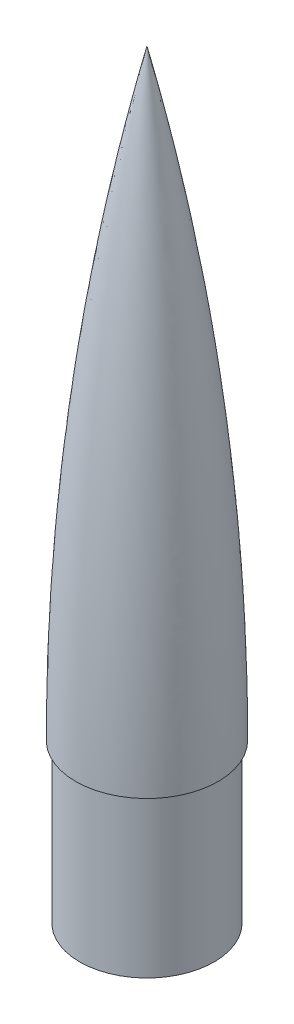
ISO-10303-21;
HEADER;
FILE_DESCRIPTION(('STEP AP214'),'2;1');
FILE_NAME('part.step','',(''),(''),'','','');
FILE_SCHEMA(('AUTOMOTIVE_DESIGN { 1 0 10303 214 1 1 1 1 }'));
ENDSEC;
DATA;
#1=APPLICATION_CONTEXT('core data for automotive mechanical design processes');
#2=APPLICATION_PROTOCOL_DEFINITION('international standard','automotive_design',2000,#1);
#3=PRODUCT_CONTEXT('',#1,'mechanical');
#4=PRODUCT('Part','Part','',(#3));
#5=PRODUCT_RELATED_PRODUCT_CATEGORY('part','',(#4));
#6=PRODUCT_DEFINITION_FORMATION('','',#4);
#7=PRODUCT_DEFINITION_CONTEXT('part definition',#1,'design');
#8=PRODUCT_DEFINITION('design','',#6,#7);
#9=PRODUCT_DEFINITION_SHAPE('','',#8);
#10=(LENGTH_UNIT() NAMED_UNIT(*) SI_UNIT(.MILLI.,.METRE.));
#11=(NAMED_UNIT(*) PLANE_ANGLE_UNIT() SI_UNIT($,.RADIAN.));
#12=(NAMED_UNIT(*) SI_UNIT($,.STERADIAN.) SOLID_ANGLE_UNIT());
#13=UNCERTAINTY_MEASURE_WITH_UNIT(LENGTH_MEASURE(1.E-05),#10,'distance_accuracy_value','');
#14=(GEOMETRIC_REPRESENTATION_CONTEXT(3) GLOBAL_UNCERTAINTY_ASSIGNED_CONTEXT((#13)) GLOBAL_UNIT_ASSIGNED_CONTEXT((#10,
#11,#12)) REPRESENTATION_CONTEXT('',''));
#15=CARTESIAN_POINT('',(0.,0.,0.));
#16=DIRECTION('',(0.,0.,1.));
#17=DIRECTION('',(1.,0.,0.));
#18=AXIS2_PLACEMENT_3D('',#15,#16,#17);
#19=CARTESIAN_POINT('',(0.,0.,0.));
#20=DIRECTION('',(0.,-1.,0.));
#21=DIRECTION('',(0.,0.,-1.));
#22=AXIS2_PLACEMENT_3D('',#19,#20,#21);
#23=PLANE('',#22);
#24=CARTESIAN_POINT('',(0.,0.,0.));
#25=DIRECTION('',(0.,1.,0.));
#26=DIRECTION('',(0.,0.,1.));
#27=AXIS2_PLACEMENT_3D('',#24,#25,#26);
#28=CIRCLE('',#27,26.9875);
#29=CARTESIAN_POINT('',(0.,0.,26.9875));
#30=VERTEX_POINT('',#29);
#31=EDGE_CURVE('E11',#30,#30,#28,.T.);
#32=ORIENTED_EDGE('',*,*,#31,.F.);
#33=EDGE_LOOP('',(#32));
#34=FACE_BOUND('',#33,.T.);
#35=CARTESIAN_POINT('',(0.,0.,0.));
#36=DIRECTION('',(0.,-1.,0.));
#37=DIRECTION('',(0.,0.,-1.));
#38=AXIS2_PLACEMENT_3D('',#35,#36,#37);
#39=CIRCLE('',#38,25.4);
#40=CARTESIAN_POINT('',(0.,0.,-25.4));
#41=VERTEX_POINT('',#40);
#42=EDGE_CURVE('E69',#41,#41,#39,.F.);
#43=ORIENTED_EDGE('',*,*,#42,.T.);
#44=EDGE_LOOP('',(#43));
#45=FACE_BOUND('',#44,.T.);
#46=ADVANCED_FACE('F31',(#34,#45),#23,.T.);
#47=CARTESIAN_POINT('',(0.,304.8,0.));
#48=DIRECTION('',(0.,1.,0.));
#49=DIRECTION('',(0.,0.,1.));
#50=AXIS2_PLACEMENT_3D('',#47,#48,#49);
#51=CYLINDRICAL_SURFACE('',#50,26.9875);
#52=ORIENTED_EDGE('',*,*,#31,.T.);
#53=EDGE_LOOP('',(#52));
#54=FACE_BOUND('',#53,.T.);
#55=CARTESIAN_POINT('',(0.,63.5,0.));
#56=DIRECTION('',(0.,1.,0.));
#57=DIRECTION('',(0.,0.,1.));
#58=AXIS2_PLACEMENT_3D('',#55,#56,#57);
#59=CIRCLE('',#58,26.9875);
#60=CARTESIAN_POINT('',(0.,63.5,26.9875));
#61=VERTEX_POINT('',#60);
#62=EDGE_CURVE('E38',#61,#61,#59,.T.);
#63=ORIENTED_EDGE('',*,*,#62,.F.);
#64=EDGE_LOOP('',(#63));
#65=FACE_BOUND('',#64,.T.);
#66=ADVANCED_FACE('F58',(#54,#65),#51,.T.);
#67=CARTESIAN_POINT('',(-26.9875,63.5,0.));
#68=DIRECTION('',(0.,-1.,0.));
#69=DIRECTION('',(0.,0.,-1.));
#70=AXIS2_PLACEMENT_3D('',#67,#68,#69);
#71=PLANE('',#70);
#72=ORIENTED_EDGE('',*,*,#62,.T.);
#73=EDGE_LOOP('',(#72));
#74=FACE_BOUND('',#73,.T.);
#75=CARTESIAN_POINT('',(0.,63.5,0.));
#76=DIRECTION('',(0.,1.,0.));
#77=DIRECTION('',(0.,0.,1.));
#78=AXIS2_PLACEMENT_3D('',#75,#76,#77);
#79=CIRCLE('',#78,28.575);
#80=CARTESIAN_POINT('',(0.,63.5,28.575));
#81=VERTEX_POINT('',#80);
#82=EDGE_CURVE('E71',#81,#81,#79,.T.);
#83=ORIENTED_EDGE('',*,*,#82,.F.);
#84=EDGE_LOOP('',(#83));
#85=FACE_BOUND('',#84,.T.);
#86=ADVANCED_FACE('F63',(#74,#85),#71,.T.);
#87=CARTESIAN_POINT('',(0.,63.5000000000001,-1004.53472222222));
#88=DIRECTION('',(-1.,0.,0.));
#89=DIRECTION('',(0.,0.,1.));
#90=AXIS2_PLACEMENT_3D('',#87,#88,#89);
#91=CIRCLE('',#90,1033.10972222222);
#92=TRIMMED_CURVE('',#91,(PARAMETER_VALUE(-0.235744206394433)),
(PARAMETER_VALUE(0.235744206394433)),.T.,.PARAMETER.);
#93=CARTESIAN_POINT('',(0.,63.5000000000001,0.));
#94=DIRECTION('',(0.,1.,0.));
#95=AXIS1_PLACEMENT('',#93,#94);
#96=SURFACE_OF_REVOLUTION('',#92,#95);
#97=ORIENTED_EDGE('',*,*,#82,.T.);
#98=EDGE_LOOP('',(#97));
#99=FACE_BOUND('',#98,.T.);
#100=CARTESIAN_POINT('',(0.,304.8,0.));
#101=VERTEX_POINT('',#100);
#102=VERTEX_LOOP('',#101);
#103=FACE_BOUND('',#102,.T.);
#104=ADVANCED_FACE('F86',(#99,#103),#96,.T.);
#105=CARTESIAN_POINT('',(0.,304.8,0.));
#106=DIRECTION('',(0.,1.,0.));
#107=DIRECTION('',(0.,0.,1.));
#108=AXIS2_PLACEMENT_3D('',#105,#106,#107);
#109=CYLINDRICAL_SURFACE('',#108,25.4);
#110=ORIENTED_EDGE('',*,*,#42,.F.);
#111=EDGE_LOOP('',(#110));
#112=FACE_BOUND('',#111,.T.);
#113=CARTESIAN_POINT('',(0.,65.0875,0.));
#114=DIRECTION('',(0.,-1.,0.));
#115=DIRECTION('',(0.,0.,-1.));
#116=AXIS2_PLACEMENT_3D('',#113,#114,#115);
#117=CIRCLE('',#116,25.4);
#118=CARTESIAN_POINT('',(0.,65.0875,-25.4));
#119=VERTEX_POINT('',#118);
#120=EDGE_CURVE('E72',#119,#119,#117,.F.);
#121=ORIENTED_EDGE('',*,*,#120,.T.);
#122=EDGE_LOOP('',(#121));
#123=FACE_BOUND('',#122,.T.);
#124=ADVANCED_FACE('F52',(#112,#123),#109,.F.);
#125=CARTESIAN_POINT('',(-26.9875,65.0875,0.));
#126=DIRECTION('',(0.,-1.,0.));
#127=DIRECTION('',(0.,0.,-1.));
#128=AXIS2_PLACEMENT_3D('',#125,#126,#127);
#129=PLANE('',#128);
#130=ORIENTED_EDGE('',*,*,#120,.F.);
#131=EDGE_LOOP('',(#130));
#132=FACE_BOUND('',#131,.T.);
#133=CARTESIAN_POINT('',(0.,65.0875,0.));
#134=DIRECTION('',(0.,-1.,0.));
#135=DIRECTION('',(0.,0.,-1.));
#136=AXIS2_PLACEMENT_3D('',#133,#134,#135);
#137=CIRCLE('',#136,26.9862784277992);
#138=CARTESIAN_POINT('',(0.,65.0875,-26.9862784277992));
#139=VERTEX_POINT('',#138);
#140=EDGE_CURVE('E77',#139,#139,#137,.F.);
#141=ORIENTED_EDGE('',*,*,#140,.T.);
#142=EDGE_LOOP('',(#141));
#143=FACE_BOUND('',#142,.T.);
#144=ADVANCED_FACE('F46',(#132,#143),#129,.F.);
#145=CARTESIAN_POINT('',(0.,63.5000000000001,-1004.53472222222));
#146=DIRECTION('',(-1.,0.,0.));
#147=DIRECTION('',(0.,0.,1.));
#148=AXIS2_PLACEMENT_3D('',#145,#146,#147);
#149=CIRCLE('',#148,1031.52222222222);
#150=TRIMMED_CURVE('',#149,(PARAMETER_VALUE(-0.229249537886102)),
(PARAMETER_VALUE(0.229249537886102)),.T.,.PARAMETER.);
#151=CARTESIAN_POINT('',(0.,63.5000000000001,0.));
#152=DIRECTION('',(0.,1.,0.));
#153=AXIS1_PLACEMENT('',#151,#152);
#154=SURFACE_OF_REVOLUTION('',#150,#153);
#155=ORIENTED_EDGE('',*,*,#140,.F.);
#156=EDGE_LOOP('',(#155));
#157=FACE_BOUND('',#156,.T.);
#158=CARTESIAN_POINT('',(0.,297.910082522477,0.));
#159=VERTEX_POINT('',#158);
#160=VERTEX_LOOP('',#159);
#161=FACE_BOUND('',#160,.T.);
#162=ADVANCED_FACE('F44',(#157,#161),#154,.F.);
#163=CLOSED_SHELL('',(#46,#66,#86,#104,#124,#144,#162));
#164=MANIFOLD_SOLID_BREP('B2',#163);
#165=ADVANCED_BREP_SHAPE_REPRESENTATION('',(#18,#164),#14);
#166=SHAPE_DEFINITION_REPRESENTATION(#9,#165);
ENDSEC;
END-ISO-10303-21;
